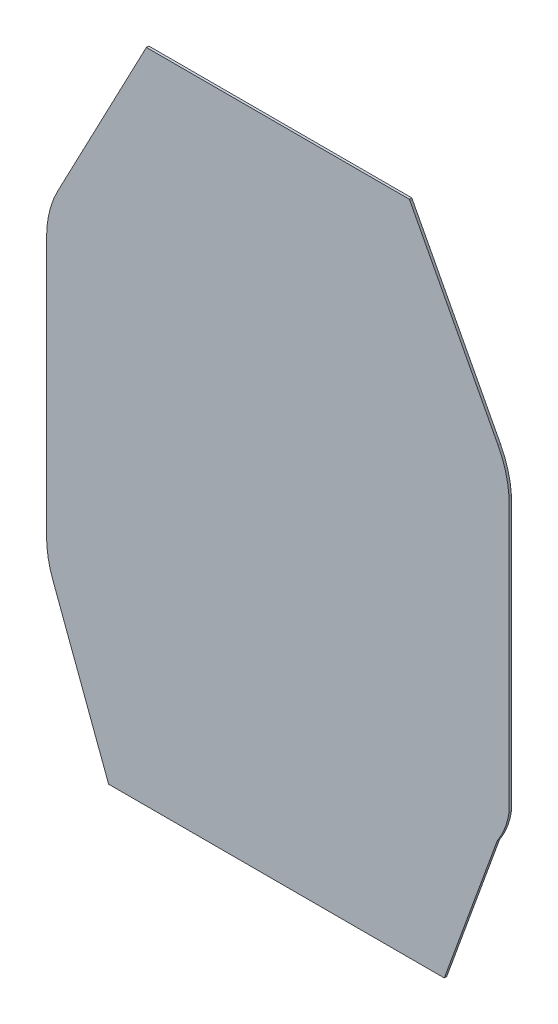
ISO-10303-21;
HEADER;
FILE_DESCRIPTION(('STEP AP214'),'2;1');
FILE_NAME('part.step','',(''),(''),'','','');
FILE_SCHEMA(('AUTOMOTIVE_DESIGN { 1 0 10303 214 1 1 1 1 }'));
ENDSEC;
DATA;
#1=APPLICATION_CONTEXT('core data for automotive mechanical design processes');
#2=APPLICATION_PROTOCOL_DEFINITION('international standard','automotive_design',2000,#1);
#3=PRODUCT_CONTEXT('',#1,'mechanical');
#4=PRODUCT('Part','Part','',(#3));
#5=PRODUCT_RELATED_PRODUCT_CATEGORY('part','',(#4));
#6=PRODUCT_DEFINITION_FORMATION('','',#4);
#7=PRODUCT_DEFINITION_CONTEXT('part definition',#1,'design');
#8=PRODUCT_DEFINITION('design','',#6,#7);
#9=PRODUCT_DEFINITION_SHAPE('','',#8);
#10=(LENGTH_UNIT() NAMED_UNIT(*) SI_UNIT(.MILLI.,.METRE.));
#11=(NAMED_UNIT(*) PLANE_ANGLE_UNIT() SI_UNIT($,.RADIAN.));
#12=(NAMED_UNIT(*) SI_UNIT($,.STERADIAN.) SOLID_ANGLE_UNIT());
#13=UNCERTAINTY_MEASURE_WITH_UNIT(LENGTH_MEASURE(1.E-05),#10,'distance_accuracy_value','');
#14=(GEOMETRIC_REPRESENTATION_CONTEXT(3) GLOBAL_UNCERTAINTY_ASSIGNED_CONTEXT((#13)) GLOBAL_UNIT_ASSIGNED_CONTEXT((#10,
#11,#12)) REPRESENTATION_CONTEXT('',''));
#15=CARTESIAN_POINT('',(0.,0.,0.));
#16=DIRECTION('',(0.,0.,1.));
#17=DIRECTION('',(1.,0.,0.));
#18=AXIS2_PLACEMENT_3D('',#15,#16,#17);
#19=CARTESIAN_POINT('',(67.0094441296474,84.2416328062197,0.));
#20=DIRECTION('',(0.,0.,1.));
#21=DIRECTION('',(1.,0.,0.));
#22=AXIS2_PLACEMENT_3D('',#19,#20,#21);
#23=PLANE('',#22);
#24=DIRECTION('',(-0.465138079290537,0.885238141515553,0.));
#25=VECTOR('',#24,1.);
#26=CARTESIAN_POINT('',(27.1737277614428,63.3104192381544,0.));
#27=LINE('',#26,#25);
#28=CARTESIAN_POINT('',(45.2454146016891,28.916876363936,0.));
#29=VERTEX_POINT('',#28);
#30=CARTESIAN_POINT('',(27.1737277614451,63.3104192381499,0.));
#31=VERTEX_POINT('',#30);
#32=EDGE_CURVE('E207',#29,#31,#27,.T.);
#33=ORIENTED_EDGE('',*,*,#32,.F.);
#34=CARTESIAN_POINT('',(27.5406517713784,19.6141147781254,0.));
#35=DIRECTION('',(0.,0.,1.));
#36=DIRECTION('',(1.,0.,0.));
#37=AXIS2_PLACEMENT_3D('',#34,#35,#36);
#38=CIRCLE('',#37,19.9999999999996);
#39=CARTESIAN_POINT('',(47.5000000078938,20.8886413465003,0.));
#40=VERTEX_POINT('',#39);
#41=EDGE_CURVE('E277',#40,#29,#38,.T.);
#42=ORIENTED_EDGE('',*,*,#41,.F.);
#43=DIRECTION('',(0.,1.,0.));
#44=VECTOR('',#43,1.);
#45=CARTESIAN_POINT('',(47.5000000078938,20.8886413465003,0.));
#46=LINE('',#45,#44);
#47=CARTESIAN_POINT('',(47.5000000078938,-35.3376368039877,0.));
#48=VERTEX_POINT('',#47);
#49=EDGE_CURVE('E213',#48,#40,#46,.T.);
#50=ORIENTED_EDGE('',*,*,#49,.F.);
#51=CARTESIAN_POINT('',(45.0527106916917,-41.6293543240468,0.));
#52=CARTESIAN_POINT('',(45.2186626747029,-41.3722642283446,0.));
#53=CARTESIAN_POINT('',(45.378689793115,-41.1112802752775,0.));
#54=CARTESIAN_POINT('',(45.6856729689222,-40.5815129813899,0.));
#55=CARTESIAN_POINT('',(45.8326202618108,-40.3127245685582,0.));
#56=CARTESIAN_POINT('',(46.1120402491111,-39.7675970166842,0.));
#57=CARTESIAN_POINT('',(46.2445085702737,-39.4912556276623,0.));
#58=CARTESIAN_POINT('',(46.4935175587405,-38.9315778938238,0.));
#59=CARTESIAN_POINT('',(46.6100638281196,-38.6482440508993,0.));
#60=CARTESIAN_POINT('',(46.8098075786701,-38.1179862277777,0.));
#61=CARTESIAN_POINT('',(46.8953856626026,-37.8719580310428,0.));
#62=CARTESIAN_POINT('',(47.0533780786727,-37.3756791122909,0.));
#63=CARTESIAN_POINT('',(47.1257915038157,-37.1254281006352,0.));
#64=CARTESIAN_POINT('',(47.2569791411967,-36.6205757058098,0.));
#65=CARTESIAN_POINT('',(47.3157123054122,-36.36596362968,0.));
#66=CARTESIAN_POINT('',(47.41878130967,-35.8538080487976,0.));
#67=CARTESIAN_POINT('',(47.463115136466,-35.596264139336,0.));
#68=CARTESIAN_POINT('',(47.5000000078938,-35.3376368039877,0.));
#69=B_SPLINE_CURVE_WITH_KNOTS('',3,(#51,#52,#53,#54,#55,#56,#57,#58,#59,#60,#61,#62,#63,#64,#65,
#66,#67,#68),.UNSPECIFIED.,.F.,.F.,(4,2,2,2,2,2,2,2,4),(0.,0.918002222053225,1.83661501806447,
2.75550451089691,3.67406986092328,4.45518665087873,5.23635723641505,6.01984239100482,
6.80343704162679),.UNSPECIFIED.);
#70=CARTESIAN_POINT('',(45.0527106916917,-41.6293543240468,0.));
#71=VERTEX_POINT('',#70);
#72=EDGE_CURVE('E139',#71,#48,#69,.T.);
#73=ORIENTED_EDGE('',*,*,#72,.F.);
#74=DIRECTION('',(0.342330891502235,0.939579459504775,0.));
#75=VECTOR('',#74,1.);
#76=CARTESIAN_POINT('',(34.2069480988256,-71.3972076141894,0.));
#77=LINE('',#76,#75);
#78=CARTESIAN_POINT('',(34.2069480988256,-71.3972076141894,0.));
#79=VERTEX_POINT('',#78);
#80=EDGE_CURVE('E140',#79,#71,#77,.T.);
#81=ORIENTED_EDGE('',*,*,#80,.F.);
#82=DIRECTION('',(1.,0.,0.));
#83=VECTOR('',#82,1.);
#84=CARTESIAN_POINT('',(-34.7538699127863,-71.3972076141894,0.));
#85=LINE('',#84,#83);
#86=CARTESIAN_POINT('',(-34.7538699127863,-71.3972076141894,0.));
#87=VERTEX_POINT('',#86);
#88=EDGE_CURVE('E136',#87,#79,#85,.T.);
#89=ORIENTED_EDGE('',*,*,#88,.F.);
#90=DIRECTION('',(0.350776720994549,-0.936459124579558,0.));
#91=VECTOR('',#90,1.);
#92=CARTESIAN_POINT('',(-46.2291808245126,-40.7618804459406,0.));
#93=LINE('',#92,#91);
#94=CARTESIAN_POINT('',(-46.2291816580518,-40.7618782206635,0.));
#95=VERTEX_POINT('',#94);
#96=EDGE_CURVE('E178',#95,#87,#93,.T.);
#97=ORIENTED_EDGE('',*,*,#96,.F.);
#98=CARTESIAN_POINT('',(-27.499999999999,-33.7463415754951,0.));
#99=DIRECTION('',(0.,0.,1.));
#100=DIRECTION('',(1.,0.,0.));
#101=AXIS2_PLACEMENT_3D('',#98,#99,#100);
#102=CIRCLE('',#101,20.0000000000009);
#103=CARTESIAN_POINT('',(-47.4999999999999,-33.7463415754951,0.));
#104=VERTEX_POINT('',#103);
#105=EDGE_CURVE('E183',#104,#95,#102,.T.);
#106=ORIENTED_EDGE('',*,*,#105,.F.);
#107=DIRECTION('',(0.,-1.,0.));
#108=VECTOR('',#107,1.);
#109=CARTESIAN_POINT('',(-47.5,19.6141147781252,0.));
#110=LINE('',#109,#108);
#111=CARTESIAN_POINT('',(-47.5,19.6141147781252,0.));
#112=VERTEX_POINT('',#111);
#113=EDGE_CURVE('E187',#112,#104,#110,.T.);
#114=ORIENTED_EDGE('',*,*,#113,.F.);
#115=CARTESIAN_POINT('',(-27.5,19.6141147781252,0.));
#116=DIRECTION('',(0.,0.,1.));
#117=DIRECTION('',(1.,0.,0.));
#118=AXIS2_PLACEMENT_3D('',#115,#116,#117);
#119=CIRCLE('',#118,20.0000000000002);
#120=CARTESIAN_POINT('',(-45.2047628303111,28.9168763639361,0.));
#121=VERTEX_POINT('',#120);
#122=EDGE_CURVE('E191',#121,#112,#119,.T.);
#123=ORIENTED_EDGE('',*,*,#122,.F.);
#124=DIRECTION('',(-0.465116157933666,-0.885249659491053,0.));
#125=VECTOR('',#124,1.);
#126=CARTESIAN_POINT('',(-45.204762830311,28.916876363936,0.));
#127=LINE('',#126,#125);
#128=CARTESIAN_POINT('',(-26.9965438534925,63.5723476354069,0.));
#129=VERTEX_POINT('',#128);
#130=EDGE_CURVE('E112',#129,#121,#127,.T.);
#131=ORIENTED_EDGE('',*,*,#130,.F.);
#132=DIRECTION('',(-1.,0.,0.));
#133=VECTOR('',#132,1.);
#134=CARTESIAN_POINT('',(-26.9965438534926,63.5723476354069,0.));
#135=LINE('',#134,#133);
#136=CARTESIAN_POINT('',(27.0371956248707,63.5723476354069,0.));
#137=VERTEX_POINT('',#136);
#138=EDGE_CURVE('E109',#137,#129,#135,.T.);
#139=ORIENTED_EDGE('',*,*,#138,.F.);
#140=CARTESIAN_POINT('',(67.0094441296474,84.2416328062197,0.));
#141=DIRECTION('',(0.,0.,1.));
#142=DIRECTION('',(1.,0.,0.));
#143=AXIS2_PLACEMENT_3D('',#140,#141,#142);
#144=CIRCLE('',#143,45.);
#145=EDGE_CURVE('E21',#137,#31,#144,.T.);
#146=ORIENTED_EDGE('',*,*,#145,.T.);
#147=EDGE_LOOP('',(#33,#42,#50,#73,#81,#89,#97,#106,#114,#123,#131,#139,#146));
#148=FACE_BOUND('',#147,.T.);
#149=ADVANCED_FACE('F17',(#148),#23,.F.);
#150=CARTESIAN_POINT('',(67.0094441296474,84.2416328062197,0.5));
#151=DIRECTION('',(0.,0.,1.));
#152=DIRECTION('',(1.,0.,0.));
#153=AXIS2_PLACEMENT_3D('',#150,#151,#152);
#154=CYLINDRICAL_SURFACE('',#153,45.);
#155=DIRECTION('',(0.,0.,1.));
#156=VECTOR('',#155,1.);
#157=CARTESIAN_POINT('',(27.0371956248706,63.5723476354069,0.5));
#158=LINE('',#157,#156);
#159=CARTESIAN_POINT('',(27.0371956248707,63.5723476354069,0.5));
#160=VERTEX_POINT('',#159);
#161=EDGE_CURVE('E204',#160,#137,#158,.F.);
#162=ORIENTED_EDGE('',*,*,#161,.F.);
#163=CARTESIAN_POINT('',(67.0094441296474,84.2416328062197,0.5));
#164=DIRECTION('',(0.,0.,1.));
#165=DIRECTION('',(1.,0.,0.));
#166=AXIS2_PLACEMENT_3D('',#163,#164,#165);
#167=CIRCLE('',#166,45.);
#168=CARTESIAN_POINT('',(27.1737277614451,63.3104192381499,0.5));
#169=VERTEX_POINT('',#168);
#170=EDGE_CURVE('E201',#169,#160,#167,.F.);
#171=ORIENTED_EDGE('',*,*,#170,.F.);
#172=DIRECTION('',(0.,0.,1.));
#173=VECTOR('',#172,1.);
#174=CARTESIAN_POINT('',(27.1737277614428,63.3104192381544,0.5));
#175=LINE('',#174,#173);
#176=EDGE_CURVE('E211',#31,#169,#175,.T.);
#177=ORIENTED_EDGE('',*,*,#176,.F.);
#178=ORIENTED_EDGE('',*,*,#145,.F.);
#179=EDGE_LOOP('',(#162,#171,#177,#178));
#180=FACE_BOUND('',#179,.T.);
#181=ADVANCED_FACE('F337',(#180),#154,.F.);
#182=CARTESIAN_POINT('',(-26.9965438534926,63.5723476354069,0.5));
#183=DIRECTION('',(0.,1.,0.));
#184=DIRECTION('',(-1.,0.,0.));
#185=AXIS2_PLACEMENT_3D('',#182,#183,#184);
#186=PLANE('',#185);
#187=DIRECTION('',(1.,0.,0.));
#188=VECTOR('',#187,1.);
#189=CARTESIAN_POINT('',(67.0094441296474,63.5723476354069,0.5));
#190=LINE('',#189,#188);
#191=CARTESIAN_POINT('',(-26.9965438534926,63.5723476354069,0.5));
#192=VERTEX_POINT('',#191);
#193=EDGE_CURVE('E197',#160,#192,#190,.F.);
#194=ORIENTED_EDGE('',*,*,#193,.F.);
#195=ORIENTED_EDGE('',*,*,#161,.T.);
#196=ORIENTED_EDGE('',*,*,#138,.T.);
#197=DIRECTION('',(0.,0.,1.));
#198=VECTOR('',#197,1.);
#199=CARTESIAN_POINT('',(-26.9965438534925,63.5723476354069,0.5));
#200=LINE('',#199,#198);
#201=EDGE_CURVE('E192',#192,#129,#200,.F.);
#202=ORIENTED_EDGE('',*,*,#201,.F.);
#203=EDGE_LOOP('',(#194,#195,#196,#202));
#204=FACE_BOUND('',#203,.T.);
#205=ADVANCED_FACE('F349',(#204),#186,.T.);
#206=CARTESIAN_POINT('',(-45.204762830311,28.916876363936,0.5));
#207=DIRECTION('',(-0.885249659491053,0.465116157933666,0.));
#208=DIRECTION('',(-0.465116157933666,-0.885249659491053,0.));
#209=AXIS2_PLACEMENT_3D('',#206,#207,#208);
#210=PLANE('',#209);
#211=DIRECTION('',(-0.465116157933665,-0.885249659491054,0.));
#212=VECTOR('',#211,1.);
#213=CARTESIAN_POINT('',(-26.9965438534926,63.5723476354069,0.5));
#214=LINE('',#213,#212);
#215=CARTESIAN_POINT('',(-45.2047628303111,28.9168763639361,0.5));
#216=VERTEX_POINT('',#215);
#217=EDGE_CURVE('E200',#192,#216,#214,.T.);
#218=ORIENTED_EDGE('',*,*,#217,.F.);
#219=ORIENTED_EDGE('',*,*,#201,.T.);
#220=ORIENTED_EDGE('',*,*,#130,.T.);
#221=DIRECTION('',(0.,0.,1.));
#222=VECTOR('',#221,1.);
#223=CARTESIAN_POINT('',(-45.2047628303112,28.9168763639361,0.5));
#224=LINE('',#223,#222);
#225=EDGE_CURVE('E188',#216,#121,#224,.F.);
#226=ORIENTED_EDGE('',*,*,#225,.F.);
#227=EDGE_LOOP('',(#218,#219,#220,#226));
#228=FACE_BOUND('',#227,.T.);
#229=ADVANCED_FACE('F356',(#228),#210,.T.);
#230=CARTESIAN_POINT('',(-27.5,19.6141147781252,0.5));
#231=DIRECTION('',(0.,0.,1.));
#232=DIRECTION('',(1.,0.,0.));
#233=AXIS2_PLACEMENT_3D('',#230,#231,#232);
#234=CYLINDRICAL_SURFACE('',#233,20.0000000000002);
#235=CARTESIAN_POINT('',(-27.5,19.6141147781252,0.5));
#236=DIRECTION('',(0.,0.,1.));
#237=DIRECTION('',(1.,0.,0.));
#238=AXIS2_PLACEMENT_3D('',#235,#236,#237);
#239=CIRCLE('',#238,20.0000000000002);
#240=CARTESIAN_POINT('',(-47.5,19.6141147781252,0.5));
#241=VERTEX_POINT('',#240);
#242=EDGE_CURVE('E293',#216,#241,#239,.T.);
#243=ORIENTED_EDGE('',*,*,#242,.F.);
#244=ORIENTED_EDGE('',*,*,#225,.T.);
#245=ORIENTED_EDGE('',*,*,#122,.T.);
#246=DIRECTION('',(0.,0.,1.));
#247=VECTOR('',#246,1.);
#248=CARTESIAN_POINT('',(-47.5,19.6141147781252,0.5));
#249=LINE('',#248,#247);
#250=EDGE_CURVE('E184',#241,#112,#249,.F.);
#251=ORIENTED_EDGE('',*,*,#250,.F.);
#252=EDGE_LOOP('',(#243,#244,#245,#251));
#253=FACE_BOUND('',#252,.T.);
#254=ADVANCED_FACE('F284',(#253),#234,.T.);
#255=CARTESIAN_POINT('',(-47.5,19.6141147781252,0.5));
#256=DIRECTION('',(-1.,0.,0.));
#257=DIRECTION('',(0.,-1.,0.));
#258=AXIS2_PLACEMENT_3D('',#255,#256,#257);
#259=PLANE('',#258);
#260=DIRECTION('',(0.,1.,0.));
#261=VECTOR('',#260,1.);
#262=CARTESIAN_POINT('',(-47.5,84.2416328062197,0.5));
#263=LINE('',#262,#261);
#264=CARTESIAN_POINT('',(-47.5,-33.7463415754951,0.5));
#265=VERTEX_POINT('',#264);
#266=EDGE_CURVE('E289',#241,#265,#263,.F.);
#267=ORIENTED_EDGE('',*,*,#266,.F.);
#268=ORIENTED_EDGE('',*,*,#250,.T.);
#269=ORIENTED_EDGE('',*,*,#113,.T.);
#270=DIRECTION('',(0.,0.,1.));
#271=VECTOR('',#270,1.);
#272=CARTESIAN_POINT('',(-47.4999999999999,-33.7463415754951,0.5));
#273=LINE('',#272,#271);
#274=EDGE_CURVE('E179',#265,#104,#273,.F.);
#275=ORIENTED_EDGE('',*,*,#274,.F.);
#276=EDGE_LOOP('',(#267,#268,#269,#275));
#277=FACE_BOUND('',#276,.T.);
#278=ADVANCED_FACE('F287',(#277),#259,.T.);
#279=CARTESIAN_POINT('',(-27.499999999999,-33.7463415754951,0.5));
#280=DIRECTION('',(0.,0.,1.));
#281=DIRECTION('',(1.,0.,0.));
#282=AXIS2_PLACEMENT_3D('',#279,#280,#281);
#283=CYLINDRICAL_SURFACE('',#282,20.0000000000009);
#284=CARTESIAN_POINT('',(-27.499999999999,-33.7463415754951,0.5));
#285=DIRECTION('',(0.,0.,1.));
#286=DIRECTION('',(1.,0.,0.));
#287=AXIS2_PLACEMENT_3D('',#284,#285,#286);
#288=CIRCLE('',#287,20.0000000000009);
#289=CARTESIAN_POINT('',(-46.2291816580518,-40.7618782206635,0.5));
#290=VERTEX_POINT('',#289);
#291=EDGE_CURVE('E163',#265,#290,#288,.T.);
#292=ORIENTED_EDGE('',*,*,#291,.F.);
#293=ORIENTED_EDGE('',*,*,#274,.T.);
#294=ORIENTED_EDGE('',*,*,#105,.T.);
#295=DIRECTION('',(0.,0.,1.));
#296=VECTOR('',#295,1.);
#297=CARTESIAN_POINT('',(-46.2291808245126,-40.7618804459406,0.5));
#298=LINE('',#297,#296);
#299=EDGE_CURVE('E175',#290,#95,#298,.F.);
#300=ORIENTED_EDGE('',*,*,#299,.F.);
#301=EDGE_LOOP('',(#292,#293,#294,#300));
#302=FACE_BOUND('',#301,.T.);
#303=ADVANCED_FACE('F377',(#302),#283,.T.);
#304=CARTESIAN_POINT('',(-46.2291808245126,-40.7618804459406,0.5));
#305=DIRECTION('',(-0.936459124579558,-0.350776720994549,0.));
#306=DIRECTION('',(0.350776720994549,-0.936459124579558,0.));
#307=AXIS2_PLACEMENT_3D('',#304,#305,#306);
#308=PLANE('',#307);
#309=DIRECTION('',(0.350776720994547,-0.936459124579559,0.));
#310=VECTOR('',#309,1.);
#311=CARTESIAN_POINT('',(-46.2291808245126,-40.7618804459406,0.5));
#312=LINE('',#311,#310);
#313=CARTESIAN_POINT('',(-34.7538699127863,-71.3972076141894,0.5));
#314=VERTEX_POINT('',#313);
#315=EDGE_CURVE('E156',#290,#314,#312,.T.);
#316=ORIENTED_EDGE('',*,*,#315,.F.);
#317=ORIENTED_EDGE('',*,*,#299,.T.);
#318=ORIENTED_EDGE('',*,*,#96,.T.);
#319=DIRECTION('',(0.,0.,-1.));
#320=VECTOR('',#319,1.);
#321=CARTESIAN_POINT('',(-34.7538699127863,-71.3972076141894,0.5));
#322=LINE('',#321,#320);
#323=EDGE_CURVE('E170',#314,#87,#322,.T.);
#324=ORIENTED_EDGE('',*,*,#323,.F.);
#325=EDGE_LOOP('',(#316,#317,#318,#324));
#326=FACE_BOUND('',#325,.T.);
#327=ADVANCED_FACE('F384',(#326),#308,.T.);
#328=CARTESIAN_POINT('',(-34.7538699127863,-71.3972076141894,0.5));
#329=DIRECTION('',(0.,-1.,0.));
#330=DIRECTION('',(0.,0.,-1.));
#331=AXIS2_PLACEMENT_3D('',#328,#329,#330);
#332=PLANE('',#331);
#333=DIRECTION('',(1.,0.,0.));
#334=VECTOR('',#333,1.);
#335=CARTESIAN_POINT('',(67.0094441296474,-71.3972076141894,0.5));
#336=LINE('',#335,#334);
#337=CARTESIAN_POINT('',(34.2069480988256,-71.3972076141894,0.5));
#338=VERTEX_POINT('',#337);
#339=EDGE_CURVE('E134',#314,#338,#336,.T.);
#340=ORIENTED_EDGE('',*,*,#339,.F.);
#341=ORIENTED_EDGE('',*,*,#323,.T.);
#342=ORIENTED_EDGE('',*,*,#88,.T.);
#343=DIRECTION('',(0.,0.,1.));
#344=VECTOR('',#343,1.);
#345=CARTESIAN_POINT('',(34.2069480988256,-71.3972076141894,0.5));
#346=LINE('',#345,#344);
#347=EDGE_CURVE('E129',#338,#79,#346,.F.);
#348=ORIENTED_EDGE('',*,*,#347,.F.);
#349=EDGE_LOOP('',(#340,#341,#342,#348));
#350=FACE_BOUND('',#349,.T.);
#351=ADVANCED_FACE('F131',(#350),#332,.T.);
#352=CARTESIAN_POINT('',(34.2069480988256,-71.3972076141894,0.5));
#353=DIRECTION('',(0.939579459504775,-0.342330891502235,0.));
#354=DIRECTION('',(0.342330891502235,0.939579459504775,0.));
#355=AXIS2_PLACEMENT_3D('',#352,#353,#354);
#356=PLANE('',#355);
#357=DIRECTION('',(0.342330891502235,0.939579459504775,0.));
#358=VECTOR('',#357,1.);
#359=CARTESIAN_POINT('',(34.2069480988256,-71.3972076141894,0.5));
#360=LINE('',#359,#358);
#361=CARTESIAN_POINT('',(45.0527106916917,-41.6293543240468,0.5));
#362=VERTEX_POINT('',#361);
#363=EDGE_CURVE('E143',#338,#362,#360,.T.);
#364=ORIENTED_EDGE('',*,*,#363,.F.);
#365=ORIENTED_EDGE('',*,*,#347,.T.);
#366=ORIENTED_EDGE('',*,*,#80,.T.);
#367=DIRECTION('',(0.,0.,-1.));
#368=VECTOR('',#367,1.);
#369=CARTESIAN_POINT('',(45.0527106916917,-41.6293543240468,0.5));
#370=LINE('',#369,#368);
#371=EDGE_CURVE('E146',#362,#71,#370,.T.);
#372=ORIENTED_EDGE('',*,*,#371,.F.);
#373=EDGE_LOOP('',(#364,#365,#366,#372));
#374=FACE_BOUND('',#373,.T.);
#375=ADVANCED_FACE('F144',(#374),#356,.T.);
#376=CARTESIAN_POINT('',(47.5000000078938,-35.3376368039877,0.5));
#377=CARTESIAN_POINT('',(47.194521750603,-37.4777387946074,0.5));
#378=CARTESIAN_POINT('',(46.3787586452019,-39.5749779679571,0.5));
#379=CARTESIAN_POINT('',(45.0527106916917,-41.6293543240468,0.5));
#380=(BOUNDED_CURVE() B_SPLINE_CURVE(3,(#376,#377,#378,#379),.UNSPECIFIED.,.F.,
.F.) B_SPLINE_CURVE_WITH_KNOTS((4,4),(0.,1.),
.UNSPECIFIED.) CURVE() GEOMETRIC_REPRESENTATION_ITEM() RATIONAL_B_SPLINE_CURVE((1.,1.,1.,1.)) REPRESENTATION_ITEM(''));
#381=DIRECTION('',(0.,0.,-1.));
#382=VECTOR('',#381,1.);
#383=SURFACE_OF_LINEAR_EXTRUSION('',#380,#382);
#384=CARTESIAN_POINT('',(45.0527106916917,-41.6293543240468,0.5));
#385=CARTESIAN_POINT('',(45.2186626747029,-41.3722642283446,0.5));
#386=CARTESIAN_POINT('',(45.378689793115,-41.1112802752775,0.5));
#387=CARTESIAN_POINT('',(45.6856729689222,-40.5815129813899,0.5));
#388=CARTESIAN_POINT('',(45.8326202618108,-40.3127245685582,0.5));
#389=CARTESIAN_POINT('',(46.1120402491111,-39.7675970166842,0.5));
#390=CARTESIAN_POINT('',(46.2445085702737,-39.4912556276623,0.5));
#391=CARTESIAN_POINT('',(46.4935175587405,-38.9315778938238,0.5));
#392=CARTESIAN_POINT('',(46.6100638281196,-38.6482440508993,0.5));
#393=CARTESIAN_POINT('',(46.8098075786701,-38.1179862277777,0.5));
#394=CARTESIAN_POINT('',(46.8953856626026,-37.8719580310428,0.5));
#395=CARTESIAN_POINT('',(47.0533780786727,-37.3756791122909,0.5));
#396=CARTESIAN_POINT('',(47.1257915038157,-37.1254281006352,0.5));
#397=CARTESIAN_POINT('',(47.2569791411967,-36.6205757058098,0.5));
#398=CARTESIAN_POINT('',(47.3157123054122,-36.36596362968,0.5));
#399=CARTESIAN_POINT('',(47.41878130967,-35.8538080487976,0.5));
#400=CARTESIAN_POINT('',(47.463115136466,-35.596264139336,0.5));
#401=CARTESIAN_POINT('',(47.5000000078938,-35.3376368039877,0.5));
#402=B_SPLINE_CURVE_WITH_KNOTS('',3,(#384,#385,#386,#387,#388,#389,#390,#391,#392,#393,#394,
#395,#396,#397,#398,#399,#400,#401),.UNSPECIFIED.,.F.,.F.,(4,2,2,2,2,2,2,2,4),(0.,
0.918002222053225,1.83661501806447,2.75550451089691,3.67406986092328,4.45518665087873,
5.23635723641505,6.01984239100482,6.80343704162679),.UNSPECIFIED.);
#403=CARTESIAN_POINT('',(47.5000000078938,-35.3376368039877,0.5));
#404=VERTEX_POINT('',#403);
#405=EDGE_CURVE('E150',#362,#404,#402,.T.);
#406=ORIENTED_EDGE('',*,*,#405,.F.);
#407=ORIENTED_EDGE('',*,*,#371,.T.);
#408=ORIENTED_EDGE('',*,*,#72,.T.);
#409=DIRECTION('',(0.,0.,-1.));
#410=VECTOR('',#409,1.);
#411=CARTESIAN_POINT('',(47.5000000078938,-35.3376368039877,0.5));
#412=LINE('',#411,#410);
#413=EDGE_CURVE('E217',#404,#48,#412,.T.);
#414=ORIENTED_EDGE('',*,*,#413,.F.);
#415=EDGE_LOOP('',(#406,#407,#408,#414));
#416=FACE_BOUND('',#415,.T.);
#417=ADVANCED_FACE('F249',(#416),#383,.T.);
#418=CARTESIAN_POINT('',(47.5000000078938,20.8886413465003,0.5));
#419=DIRECTION('',(1.,0.,0.));
#420=DIRECTION('',(0.,0.,-1.));
#421=AXIS2_PLACEMENT_3D('',#418,#419,#420);
#422=PLANE('',#421);
#423=DIRECTION('',(0.,1.,0.));
#424=VECTOR('',#423,1.);
#425=CARTESIAN_POINT('',(47.5000000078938,84.2416328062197,0.5));
#426=LINE('',#425,#424);
#427=CARTESIAN_POINT('',(47.5000000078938,20.8886413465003,0.5));
#428=VERTEX_POINT('',#427);
#429=EDGE_CURVE('E239',#404,#428,#426,.T.);
#430=ORIENTED_EDGE('',*,*,#429,.F.);
#431=ORIENTED_EDGE('',*,*,#413,.T.);
#432=ORIENTED_EDGE('',*,*,#49,.T.);
#433=DIRECTION('',(0.,0.,1.));
#434=VECTOR('',#433,1.);
#435=CARTESIAN_POINT('',(47.5000000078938,20.8886413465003,0.5));
#436=LINE('',#435,#434);
#437=EDGE_CURVE('E212',#428,#40,#436,.F.);
#438=ORIENTED_EDGE('',*,*,#437,.F.);
#439=EDGE_LOOP('',(#430,#431,#432,#438));
#440=FACE_BOUND('',#439,.T.);
#441=ADVANCED_FACE('F255',(#440),#422,.T.);
#442=CARTESIAN_POINT('',(27.5406517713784,19.6141147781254,0.5));
#443=DIRECTION('',(0.,0.,1.));
#444=DIRECTION('',(1.,0.,0.));
#445=AXIS2_PLACEMENT_3D('',#442,#443,#444);
#446=CYLINDRICAL_SURFACE('',#445,19.9999999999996);
#447=CARTESIAN_POINT('',(27.5406517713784,19.6141147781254,0.5));
#448=DIRECTION('',(0.,0.,1.));
#449=DIRECTION('',(1.,0.,0.));
#450=AXIS2_PLACEMENT_3D('',#447,#448,#449);
#451=CIRCLE('',#450,19.9999999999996);
#452=CARTESIAN_POINT('',(45.2454146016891,28.916876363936,0.5));
#453=VERTEX_POINT('',#452);
#454=EDGE_CURVE('E28',#428,#453,#451,.T.);
#455=ORIENTED_EDGE('',*,*,#454,.F.);
#456=ORIENTED_EDGE('',*,*,#437,.T.);
#457=ORIENTED_EDGE('',*,*,#41,.T.);
#458=DIRECTION('',(0.,0.,1.));
#459=VECTOR('',#458,1.);
#460=CARTESIAN_POINT('',(45.2454146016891,28.916876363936,0.5));
#461=LINE('',#460,#459);
#462=EDGE_CURVE('E41',#453,#29,#461,.F.);
#463=ORIENTED_EDGE('',*,*,#462,.F.);
#464=EDGE_LOOP('',(#455,#456,#457,#463));
#465=FACE_BOUND('',#464,.T.);
#466=ADVANCED_FACE('F320',(#465),#446,.T.);
#467=CARTESIAN_POINT('',(27.1737277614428,63.3104192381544,0.5));
#468=DIRECTION('',(0.885238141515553,0.465138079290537,0.));
#469=DIRECTION('',(-0.465138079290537,0.885238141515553,0.));
#470=AXIS2_PLACEMENT_3D('',#467,#468,#469);
#471=PLANE('',#470);
#472=DIRECTION('',(-0.465138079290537,0.885238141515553,0.));
#473=VECTOR('',#472,1.);
#474=CARTESIAN_POINT('',(45.2454146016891,28.916876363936,0.5));
#475=LINE('',#474,#473);
#476=EDGE_CURVE('E11',#453,#169,#475,.T.);
#477=ORIENTED_EDGE('',*,*,#476,.F.);
#478=ORIENTED_EDGE('',*,*,#462,.T.);
#479=ORIENTED_EDGE('',*,*,#32,.T.);
#480=ORIENTED_EDGE('',*,*,#176,.T.);
#481=EDGE_LOOP('',(#477,#478,#479,#480));
#482=FACE_BOUND('',#481,.T.);
#483=ADVANCED_FACE('F322',(#482),#471,.T.);
#484=CARTESIAN_POINT('',(67.0094441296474,84.2416328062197,0.5));
#485=DIRECTION('',(0.,0.,1.));
#486=DIRECTION('',(1.,0.,0.));
#487=AXIS2_PLACEMENT_3D('',#484,#485,#486);
#488=PLANE('',#487);
#489=ORIENTED_EDGE('',*,*,#454,.T.);
#490=ORIENTED_EDGE('',*,*,#476,.T.);
#491=ORIENTED_EDGE('',*,*,#170,.T.);
#492=ORIENTED_EDGE('',*,*,#193,.T.);
#493=ORIENTED_EDGE('',*,*,#217,.T.);
#494=ORIENTED_EDGE('',*,*,#242,.T.);
#495=ORIENTED_EDGE('',*,*,#266,.T.);
#496=ORIENTED_EDGE('',*,*,#291,.T.);
#497=ORIENTED_EDGE('',*,*,#315,.T.);
#498=ORIENTED_EDGE('',*,*,#339,.T.);
#499=ORIENTED_EDGE('',*,*,#363,.T.);
#500=ORIENTED_EDGE('',*,*,#405,.T.);
#501=ORIENTED_EDGE('',*,*,#429,.T.);
#502=EDGE_LOOP('',(#489,#490,#491,#492,#493,#494,#495,#496,#497,#498,#499,#500,#501));
#503=FACE_BOUND('',#502,.T.);
#504=ADVANCED_FACE('F153',(#503),#488,.T.);
#505=CLOSED_SHELL('',(#149,#181,#205,#229,#254,#278,#303,#327,#351,#375,#417,#441,#466,#483,#504));
#506=MANIFOLD_SOLID_BREP('B1',#505);
#507=ADVANCED_BREP_SHAPE_REPRESENTATION('',(#18,#506),#14);
#508=SHAPE_DEFINITION_REPRESENTATION(#9,#507);
ENDSEC;
END-ISO-10303-21;
